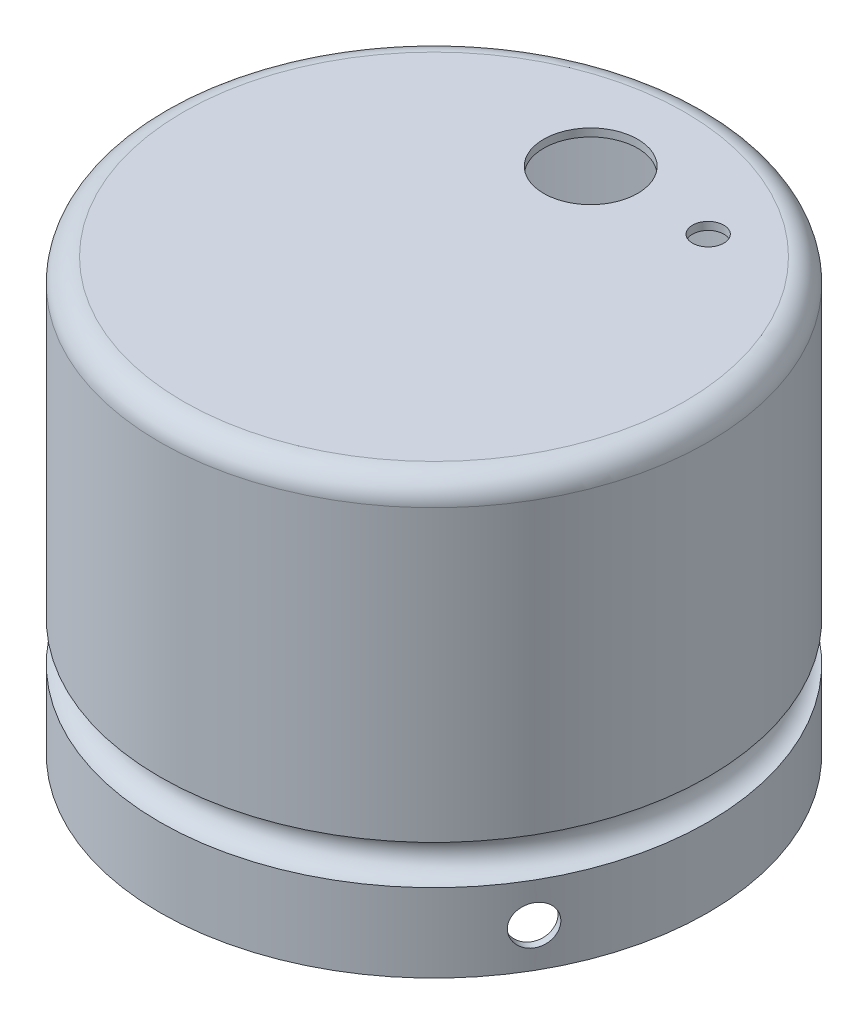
ISO-10303-21;
HEADER;
FILE_DESCRIPTION(('STEP AP214'),'2;1');
FILE_NAME('part.step','',(''),(''),'','','');
FILE_SCHEMA(('AUTOMOTIVE_DESIGN { 1 0 10303 214 1 1 1 1 }'));
ENDSEC;
DATA;
#1=APPLICATION_CONTEXT('core data for automotive mechanical design processes');
#2=APPLICATION_PROTOCOL_DEFINITION('international standard','automotive_design',2000,#1);
#3=PRODUCT_CONTEXT('',#1,'mechanical');
#4=PRODUCT('Part','Part','',(#3));
#5=PRODUCT_RELATED_PRODUCT_CATEGORY('part','',(#4));
#6=PRODUCT_DEFINITION_FORMATION('','',#4);
#7=PRODUCT_DEFINITION_CONTEXT('part definition',#1,'design');
#8=PRODUCT_DEFINITION('design','',#6,#7);
#9=PRODUCT_DEFINITION_SHAPE('','',#8);
#10=(LENGTH_UNIT() NAMED_UNIT(*) SI_UNIT(.MILLI.,.METRE.));
#11=(NAMED_UNIT(*) PLANE_ANGLE_UNIT() SI_UNIT($,.RADIAN.));
#12=(NAMED_UNIT(*) SI_UNIT($,.STERADIAN.) SOLID_ANGLE_UNIT());
#13=UNCERTAINTY_MEASURE_WITH_UNIT(LENGTH_MEASURE(1.E-05),#10,'distance_accuracy_value','');
#14=(GEOMETRIC_REPRESENTATION_CONTEXT(3) GLOBAL_UNCERTAINTY_ASSIGNED_CONTEXT((#13)) GLOBAL_UNIT_ASSIGNED_CONTEXT((#10,
#11,#12)) REPRESENTATION_CONTEXT('',''));
#15=CARTESIAN_POINT('',(0.,0.,0.));
#16=DIRECTION('',(0.,0.,1.));
#17=DIRECTION('',(1.,0.,0.));
#18=AXIS2_PLACEMENT_3D('',#15,#16,#17);
#19=CARTESIAN_POINT('',(0.,99.411581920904,0.));
#20=DIRECTION('',(0.,1.,0.));
#21=DIRECTION('',(0.,0.,1.));
#22=AXIS2_PLACEMENT_3D('',#19,#20,#21);
#23=CYLINDRICAL_SURFACE('',#22,35.);
#24=CARTESIAN_POINT('',(31.4834665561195,30.052571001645,15.2902365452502));
#25=CARTESIAN_POINT('',(31.4834645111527,30.1928047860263,15.2902424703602));
#26=CARTESIAN_POINT('',(31.4782867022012,30.3331356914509,15.3009164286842));
#27=CARTESIAN_POINT('',(31.4576455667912,30.6099195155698,15.3433070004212));
#28=CARTESIAN_POINT('',(31.442170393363,30.7463677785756,15.3750478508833));
#29=CARTESIAN_POINT('',(31.4012010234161,31.0113371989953,15.4585485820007));
#30=CARTESIAN_POINT('',(31.3757122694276,31.1398626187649,15.510297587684));
#31=CARTESIAN_POINT('',(31.3151712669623,31.3853950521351,15.6321673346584));
#32=CARTESIAN_POINT('',(31.2801211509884,31.5024046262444,15.7022839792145));
#33=CARTESIAN_POINT('',(31.2010359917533,31.7218411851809,15.8588472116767));
#34=CARTESIAN_POINT('',(31.1569857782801,31.8242430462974,15.945321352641));
#35=CARTESIAN_POINT('',(31.060807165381,32.0113419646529,16.1318705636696));
#36=CARTESIAN_POINT('',(31.0086784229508,32.0960382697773,16.2319462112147));
#37=CARTESIAN_POINT('',(30.8973975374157,32.2454020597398,16.4427804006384));
#38=CARTESIAN_POINT('',(30.8382380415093,32.3100483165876,16.5535501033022));
#39=CARTESIAN_POINT('',(30.7143127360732,32.4173410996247,16.7823688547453));
#40=CARTESIAN_POINT('',(30.6495470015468,32.4599879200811,16.9004178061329));
#41=CARTESIAN_POINT('',(30.5161524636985,32.5220003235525,17.1401052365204));
#42=CARTESIAN_POINT('',(30.4475305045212,32.541405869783,17.2617371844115));
#43=CARTESIAN_POINT('',(30.3081751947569,32.5565083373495,17.5052618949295));
#44=CARTESIAN_POINT('',(30.2374418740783,32.5522055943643,17.6271546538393));
#45=CARTESIAN_POINT('',(30.0960316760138,32.5200464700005,17.8675205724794));
#46=CARTESIAN_POINT('',(30.0253549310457,32.4922330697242,17.9859995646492));
#47=CARTESIAN_POINT('',(29.8860736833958,32.4139089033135,18.2164965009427));
#48=CARTESIAN_POINT('',(29.8174691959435,32.3633979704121,18.3285143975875));
#49=CARTESIAN_POINT('',(29.6844547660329,32.241064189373,18.5431691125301));
#50=CARTESIAN_POINT('',(29.6200487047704,32.1692219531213,18.6457972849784));
#51=CARTESIAN_POINT('',(29.4976358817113,32.0062789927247,18.8388578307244));
#52=CARTESIAN_POINT('',(29.439629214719,31.9151779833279,18.9292900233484));
#53=CARTESIAN_POINT('',(29.3318903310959,31.7160609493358,19.0958134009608));
#54=CARTESIAN_POINT('',(29.2821768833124,31.6080076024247,19.1718721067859));
#55=CARTESIAN_POINT('',(29.1929570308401,31.3781836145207,19.3074562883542));
#56=CARTESIAN_POINT('',(29.1534506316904,31.2564129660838,19.3669817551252));
#57=CARTESIAN_POINT('',(29.0860934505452,31.0025861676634,19.4679961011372));
#58=CARTESIAN_POINT('',(29.0582436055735,30.8705291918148,19.509483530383));
#59=CARTESIAN_POINT('',(29.0152525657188,30.5998899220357,19.5733649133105));
#60=CARTESIAN_POINT('',(29.0001111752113,30.4613077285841,19.5957591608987));
#61=CARTESIAN_POINT('',(28.9831340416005,30.1818794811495,19.6208607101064));
#62=CARTESIAN_POINT('',(28.9812689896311,30.0410391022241,19.623611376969));
#63=CARTESIAN_POINT('',(28.9908383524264,29.7608044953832,19.6094712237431));
#64=CARTESIAN_POINT('',(29.0022726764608,29.6214102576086,19.5925805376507));
#65=CARTESIAN_POINT('',(29.0379852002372,29.348173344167,19.5396116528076));
#66=CARTESIAN_POINT('',(29.0622499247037,29.2143250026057,19.5035535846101));
#67=CARTESIAN_POINT('',(29.1227031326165,28.9558042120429,19.4131682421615));
#68=CARTESIAN_POINT('',(29.1588917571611,28.8311318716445,19.3588407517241));
#69=CARTESIAN_POINT('',(29.2419348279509,28.5942626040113,19.2331720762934));
#70=CARTESIAN_POINT('',(29.2888078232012,28.4820878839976,19.1618012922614));
#71=CARTESIAN_POINT('',(29.3915016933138,28.2736220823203,19.0039068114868));
#72=CARTESIAN_POINT('',(29.4473226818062,28.1773312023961,18.9173829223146));
#73=CARTESIAN_POINT('',(29.5660790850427,28.0031893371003,18.7312347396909));
#74=CARTESIAN_POINT('',(29.6290272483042,27.9253721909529,18.6315869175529));
#75=CARTESIAN_POINT('',(29.7598326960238,27.7906185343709,18.4219326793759));
#76=CARTESIAN_POINT('',(29.827689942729,27.7336818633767,18.3119263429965));
#77=CARTESIAN_POINT('',(29.9660481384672,27.6423639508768,18.0846241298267));
#78=CARTESIAN_POINT('',(30.0365465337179,27.6079614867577,17.9673352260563));
#79=CARTESIAN_POINT('',(30.1780650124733,27.5626191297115,17.7286107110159));
#80=CARTESIAN_POINT('',(30.249085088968,27.5516789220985,17.6071751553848));
#81=CARTESIAN_POINT('',(30.3894063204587,27.553574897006,17.3638608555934));
#82=CARTESIAN_POINT('',(30.4587109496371,27.5663582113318,17.241983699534));
#83=CARTESIAN_POINT('',(30.5938636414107,27.6152284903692,17.0010175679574));
#84=CARTESIAN_POINT('',(30.6597116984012,27.6513154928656,16.8819285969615));
#85=CARTESIAN_POINT('',(30.7862681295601,27.7457561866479,16.6500197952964));
#86=CARTESIAN_POINT('',(30.8469766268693,27.8041093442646,16.537199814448));
#87=CARTESIAN_POINT('',(30.9618224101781,27.9414192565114,16.3211683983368));
#88=CARTESIAN_POINT('',(31.0159598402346,28.0203755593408,16.2179567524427));
#89=CARTESIAN_POINT('',(31.1165941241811,28.1968477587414,16.0240304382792));
#90=CARTESIAN_POINT('',(31.1630746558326,28.2944023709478,15.9333425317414));
#91=CARTESIAN_POINT('',(31.2473275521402,28.5052403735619,15.7674728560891));
#92=CARTESIAN_POINT('',(31.2850977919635,28.6185275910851,15.692294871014));
#93=CARTESIAN_POINT('',(31.3512505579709,28.857779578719,15.5597109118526));
#94=CARTESIAN_POINT('',(31.3796190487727,28.9837629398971,15.5023315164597));
#95=CARTESIAN_POINT('',(31.4263576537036,29.2446064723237,15.4073642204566));
#96=CARTESIAN_POINT('',(31.4447393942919,29.3794561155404,15.369753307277));
#97=CARTESIAN_POINT('',(31.4664605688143,29.6046947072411,15.3252147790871));
#98=CARTESIAN_POINT('',(31.4728323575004,29.6936304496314,15.3121167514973));
#99=CARTESIAN_POINT('',(31.4813360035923,29.8725544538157,15.2946257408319));
#100=CARTESIAN_POINT('',(31.4834678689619,29.9625427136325,15.2902327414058));
#101=CARTESIAN_POINT('',(31.4834665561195,30.052571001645,15.2902365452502));
#102=B_SPLINE_CURVE_WITH_KNOTS('',3,(#24,#25,#26,#27,#28,#29,#30,#31,#32,#33,#34,#35,#36,#37,
#38,#39,#40,#41,#42,#43,#44,#45,#46,#47,#48,#49,#50,#51,#52,#53,#54,#55,#56,#57,#58,#59,#60,#61,
#62,#63,#64,#65,#66,#67,#68,#69,#70,#71,#72,#73,#74,#75,#76,#77,#78,#79,#80,#81,#82,#83,#84,#85,
#86,#87,#88,#89,#90,#91,#92,#93,#94,#95,#96,#97,#98,#99,#100,#101),.UNSPECIFIED.,.T.,.F.,(4,2,2,
2,2,2,2,2,2,2,2,2,2,2,2,2,2,2,2,2,2,2,2,2,2,2,2,2,2,2,2,2,2,2,2,2,2,2,4),(0.,0.420372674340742,
0.841229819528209,1.26185853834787,1.68239351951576,2.10364327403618,2.52491091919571,
2.94662307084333,3.36832958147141,3.78930992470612,4.21028430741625,4.63049074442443,
5.05070026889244,5.47129289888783,5.89189175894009,6.31342995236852,6.73496837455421,
7.1565406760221,7.57810648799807,7.99874136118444,8.41937336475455,8.83956446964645,
9.2597605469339,9.68069175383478,10.101628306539,10.5233300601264,10.9450285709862,
11.3663293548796,11.7876244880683,12.2079818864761,12.6283399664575,13.0486879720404,
13.4690267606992,13.8902503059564,14.311576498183,14.7335288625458,15.1549889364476,
15.4248632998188,15.694737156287),.UNSPECIFIED.);
#103=CARTESIAN_POINT('',(31.4834665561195,30.052571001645,15.2902365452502));
#104=VERTEX_POINT('',#103);
#105=EDGE_CURVE('E108',#104,#104,#102,.T.);
#106=ORIENTED_EDGE('',*,*,#105,.F.);
#107=EDGE_LOOP('',(#106));
#108=FACE_BOUND('',#107,.T.);
#109=CARTESIAN_POINT('',(0.,35.052571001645,0.));
#110=DIRECTION('',(0.,1.,0.));
#111=DIRECTION('',(0.,0.,1.));
#112=AXIS2_PLACEMENT_3D('',#109,#110,#111);
#113=CIRCLE('',#112,35.);
#114=CARTESIAN_POINT('',(0.,35.052571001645,35.));
#115=VERTEX_POINT('',#114);
#116=EDGE_CURVE('E45',#115,#115,#113,.T.);
#117=ORIENTED_EDGE('',*,*,#116,.F.);
#118=EDGE_LOOP('',(#117));
#119=FACE_BOUND('',#118,.T.);
#120=CARTESIAN_POINT('',(0.,25.052571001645,0.));
#121=DIRECTION('',(0.,1.,0.));
#122=DIRECTION('',(0.,0.,1.));
#123=AXIS2_PLACEMENT_3D('',#120,#121,#122);
#124=CIRCLE('',#123,35.);
#125=CARTESIAN_POINT('',(0.,25.052571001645,35.));
#126=VERTEX_POINT('',#125);
#127=EDGE_CURVE('E50',#126,#126,#124,.T.);
#128=ORIENTED_EDGE('',*,*,#127,.T.);
#129=EDGE_LOOP('',(#128));
#130=FACE_BOUND('',#129,.T.);
#131=CARTESIAN_POINT('',(-2.5,30.052571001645,-34.9106001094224));
#132=CARTESIAN_POINT('',(-2.49999384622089,30.1928047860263,-34.9106013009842));
#133=CARTESIAN_POINT('',(-2.48816102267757,30.3331356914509,-34.9114541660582));
#134=CARTESIAN_POINT('',(-2.44112914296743,30.6099195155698,-34.9147737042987));
#135=CARTESIAN_POINT('',(-2.40590317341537,30.7463677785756,-34.9172422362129));
#136=CARTESIAN_POINT('',(-2.31310473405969,31.0113371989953,-34.9235120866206));
#137=CARTESIAN_POINT('',(-2.25554440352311,31.1398626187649,-34.9273126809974));
#138=CARTESIAN_POINT('',(-2.11973160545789,31.3853950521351,-34.935817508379));
#139=CARTESIAN_POINT('',(-2.04148375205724,31.5024046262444,-34.9405215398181));
#140=CARTESIAN_POINT('',(-1.8663534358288,31.7218411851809,-34.9503133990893));
#141=CARTESIAN_POINT('',(-1.76943952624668,31.8242430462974,-34.9554018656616));
#142=CARTESIAN_POINT('',(-1.55979386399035,32.0113419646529,-34.9653833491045));
#143=CARTESIAN_POINT('',(-1.44706143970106,32.0960382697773,-34.9702763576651));
#144=CARTESIAN_POINT('',(-1.20883323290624,32.2454020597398,-34.979321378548));
#145=CARTESIAN_POINT('',(-1.08332410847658,32.3100483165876,-34.9834726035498));
#146=CARTESIAN_POINT('',(-0.823198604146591,32.4173410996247,-34.990559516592));
#147=CARTESIAN_POINT('',(-0.688582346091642,32.4599879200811,-34.9934952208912));
#148=CARTESIAN_POINT('',(-0.414309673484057,32.5220003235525,-34.9978158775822));
#149=CARTESIAN_POINT('',(-0.274662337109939,32.541405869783,-34.9992034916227));
#150=CARTESIAN_POINT('',(0.00591390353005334,32.5565083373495,-35.0002806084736));
#151=CARTESIAN_POINT('',(0.146842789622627,32.5522055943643,-34.9999701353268));
#152=CARTESIAN_POINT('',(0.425710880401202,32.5200464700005,-34.9976882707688));
#153=CARTESIAN_POINT('',(0.563655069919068,32.4922330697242,-34.9957199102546));
#154=CARTESIAN_POINT('',(0.832911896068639,32.4139089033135,-34.9903472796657));
#155=CARTESIAN_POINT('',(0.964224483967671,32.3633979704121,-34.9869429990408));
#156=CARTESIAN_POINT('',(1.21662813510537,32.241064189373,-34.9790764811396));
#157=CARTESIAN_POINT('',(1.33770977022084,32.1692219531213,-34.9746132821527));
#158=CARTESIAN_POINT('',(1.56611151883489,32.0062789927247,-34.9651309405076));
#159=CARTESIAN_POINT('',(1.67343142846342,31.9151779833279,-34.9601117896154));
#160=CARTESIAN_POINT('',(1.87151434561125,31.7160609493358,-34.9500688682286));
#161=CARTESIAN_POINT('',(1.96223984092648,31.6080076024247,-34.9450451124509));
#162=CARTESIAN_POINT('',(2.12426911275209,31.3781836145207,-34.9355705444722));
#163=CARTESIAN_POINT('',(2.19557287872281,31.2564129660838,-34.931119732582));
#164=CARTESIAN_POINT('',(2.31673245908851,31.0025861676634,-34.9232938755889));
#165=CARTESIAN_POINT('',(2.36658654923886,30.8705291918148,-34.9199189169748));
#166=CARTESIAN_POINT('',(2.4434049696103,30.5998899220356,-34.9146282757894));
#167=CARTESIAN_POINT('',(2.47036965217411,30.4613077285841,-34.9127125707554));
#168=CARTESIAN_POINT('',(2.50059679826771,30.1818794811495,-34.9105607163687));
#169=CARTESIAN_POINT('',(2.50391147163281,30.0410391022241,-34.9103208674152));
#170=CARTESIAN_POINT('',(2.48688105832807,29.7608044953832,-34.911538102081));
#171=CARTESIAN_POINT('',(2.4665361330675,29.6214102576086,-34.9129951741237));
#172=CARTESIAN_POINT('',(2.40280747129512,29.348173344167,-34.9174386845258));
#173=CARTESIAN_POINT('',(2.35944790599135,29.2143250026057,-34.9204235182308));
#174=CARTESIAN_POINT('',(2.25094529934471,28.9558042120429,-34.9275848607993));
#175=CARTESIAN_POINT('',(2.18580200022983,28.8311318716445,-34.9317613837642));
#176=CARTESIAN_POINT('',(2.03544819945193,28.5942626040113,-34.9408444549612));
#177=CARTESIAN_POINT('',(1.95020278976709,28.4820878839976,-34.9457522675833));
#178=CARTESIAN_POINT('',(1.76211522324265,28.2736220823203,-34.9557405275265));
#179=CARTESIAN_POINT('',(1.65927284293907,28.1773312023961,-34.9608209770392));
#180=CARTESIAN_POINT('',(1.43868558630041,28.0031893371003,-34.9705929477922));
#181=CARTESIAN_POINT('',(1.32091395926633,27.9253721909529,-34.9752837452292));
#182=CARTESIAN_POINT('',(1.07394533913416,27.7906185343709,-34.9837374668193));
#183=CARTESIAN_POINT('',(0.944748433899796,27.7336818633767,-34.9875003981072));
#184=CARTESIAN_POINT('',(0.678719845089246,27.6423639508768,-34.9936710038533));
#185=CARTESIAN_POINT('',(0.541895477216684,27.6079614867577,-34.9960799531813));
#186=CARTESIAN_POINT('',(0.264394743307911,27.5626191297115,-34.9992762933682));
#187=CARTESIAN_POINT('',(0.123718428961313,27.5516789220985,-35.0000637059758));
#188=CARTESIAN_POINT('',(-0.157158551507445,27.553574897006,-34.9999283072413));
#189=CARTESIAN_POINT('',(-0.2973595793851,27.5663582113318,-34.9990092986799));
#190=CARTESIAN_POINT('',(-0.573618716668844,27.6152284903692,-34.9955718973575));
#191=CARTESIAN_POINT('',(-0.709676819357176,27.6513154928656,-34.9930535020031));
#192=CARTESIAN_POINT('',(-0.973793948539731,27.7457561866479,-34.9867001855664));
#193=CARTESIAN_POINT('',(-1.10185316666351,27.8041093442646,-34.9828652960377));
#194=CARTESIAN_POINT('',(-1.34636475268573,27.9414192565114,-34.9743089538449));
#195=CARTESIAN_POINT('',(-1.46281737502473,28.0203755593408,-34.9695875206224));
#196=CARTESIAN_POINT('',(-1.68107963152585,28.1968477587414,-34.9597762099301));
#197=CARTESIAN_POINT('',(-1.78285792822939,28.2944023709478,-34.9546855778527));
#198=CARTESIAN_POINT('',(-1.96863172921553,28.5052403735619,-34.9447158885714));
#199=CARTESIAN_POINT('',(-2.05262289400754,28.6185275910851,-34.9398368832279));
#200=CARTESIAN_POINT('',(-2.20052035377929,28.857779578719,-34.9308348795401));
#201=CARTESIAN_POINT('',(-2.26439661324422,28.9837629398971,-34.9267130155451));
#202=CARTESIAN_POINT('',(-2.37001000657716,29.2446064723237,-34.9197061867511));
#203=CARTESIAN_POINT('',(-2.41177288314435,29.3794561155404,-34.9168197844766));
#204=CARTESIAN_POINT('',(-2.46120496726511,29.6046947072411,-34.9133616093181));
#205=CARTESIAN_POINT('',(-2.47573408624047,29.6936304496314,-34.9123307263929));
#206=CARTESIAN_POINT('',(-2.49513356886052,29.8725544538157,-34.9109495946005));
#207=CARTESIAN_POINT('',(-2.50000395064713,29.9625427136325,-34.910599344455));
#208=CARTESIAN_POINT('',(-2.5,30.052571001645,-34.9106001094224));
#209=B_SPLINE_CURVE_WITH_KNOTS('',3,(#131,#132,#133,#134,#135,#136,#137,#138,#139,#140,#141,
#142,#143,#144,#145,#146,#147,#148,#149,#150,#151,#152,#153,#154,#155,#156,#157,#158,#159,#160,
#161,#162,#163,#164,#165,#166,#167,#168,#169,#170,#171,#172,#173,#174,#175,#176,#177,#178,#179,
#180,#181,#182,#183,#184,#185,#186,#187,#188,#189,#190,#191,#192,#193,#194,#195,#196,#197,#198,
#199,#200,#201,#202,#203,#204,#205,#206,#207,#208),.UNSPECIFIED.,.T.,.F.,(4,2,2,2,2,2,2,2,2,2,2,
2,2,2,2,2,2,2,2,2,2,2,2,2,2,2,2,2,2,2,2,2,2,2,2,2,2,2,4),(0.,0.420372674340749,
0.841229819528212,1.26185853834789,1.68239351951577,2.10364327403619,2.52491091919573,
2.94662307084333,3.36832958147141,3.78930992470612,4.21028430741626,4.63049074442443,
5.05070026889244,5.47129289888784,5.89189175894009,6.31342995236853,6.73496837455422,
7.15654067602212,7.57810648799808,7.99874136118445,8.41937336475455,8.83956446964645,
9.25976054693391,9.68069175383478,10.101628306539,10.5233300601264,10.9450285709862,
11.3663293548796,11.7876244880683,12.2079818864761,12.6283399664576,13.0486879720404,
13.4690267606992,13.8902503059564,14.311576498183,14.7335288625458,15.1549889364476,
15.4248632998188,15.694737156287),.UNSPECIFIED.);
#210=CARTESIAN_POINT('',(-2.5,30.052571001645,-34.9106001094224));
#211=VERTEX_POINT('',#210);
#212=EDGE_CURVE('E87',#211,#211,#209,.T.);
#213=ORIENTED_EDGE('',*,*,#212,.F.);
#214=EDGE_LOOP('',(#213));
#215=FACE_BOUND('',#214,.T.);
#216=CARTESIAN_POINT('',(-28.9834665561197,30.052571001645,19.620363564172));
#217=CARTESIAN_POINT('',(-28.9834706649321,30.1928047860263,19.6203588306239));
#218=CARTESIAN_POINT('',(-28.9901256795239,30.3331356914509,19.6105377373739));
#219=CARTESIAN_POINT('',(-29.016516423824,30.6099195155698,19.5714667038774));
#220=CARTESIAN_POINT('',(-29.0362672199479,30.7463677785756,19.5421943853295));
#221=CARTESIAN_POINT('',(-29.0880962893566,31.0113371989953,19.4649635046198));
#222=CARTESIAN_POINT('',(-29.1201678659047,31.1398626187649,19.4170150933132));
#223=CARTESIAN_POINT('',(-29.1954396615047,31.3853950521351,19.3036501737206));
#224=CARTESIAN_POINT('',(-29.2386373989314,31.5024046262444,19.2382375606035));
#225=CARTESIAN_POINT('',(-29.3346825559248,31.7218411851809,19.0914661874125));
#226=CARTESIAN_POINT('',(-29.3875462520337,31.8242430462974,19.0100805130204));
#227=CARTESIAN_POINT('',(-29.5010133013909,32.0113419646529,18.8335127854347));
#228=CARTESIAN_POINT('',(-29.56161698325,32.0960382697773,18.7383301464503));
#229=CARTESIAN_POINT('',(-29.6885643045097,32.2454020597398,18.5365409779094));
#230=CARTESIAN_POINT('',(-29.754913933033,32.3100483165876,18.4299225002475));
#231=CARTESIAN_POINT('',(-29.8911141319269,32.4173410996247,18.2081906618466));
#232=CARTESIAN_POINT('',(-29.9609646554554,32.4599879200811,18.0930774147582));
#233=CARTESIAN_POINT('',(-30.1018427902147,32.5220003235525,17.8577106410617));
#234=CARTESIAN_POINT('',(-30.1728681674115,32.541405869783,17.7374663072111));
#235=CARTESIAN_POINT('',(-30.3140890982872,32.5565083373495,17.495018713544));
#236=CARTESIAN_POINT('',(-30.3842846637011,32.5522055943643,17.3728154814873));
#237=CARTESIAN_POINT('',(-30.5217425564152,32.5200464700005,17.1301676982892));
#238=CARTESIAN_POINT('',(-30.5890100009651,32.4922330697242,17.0097203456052));
#239=CARTESIAN_POINT('',(-30.7189855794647,32.4139089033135,16.7738507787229));
#240=CARTESIAN_POINT('',(-30.7816936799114,32.3633979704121,16.6584286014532));
#241=CARTESIAN_POINT('',(-30.9010829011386,32.241064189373,16.4359073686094));
#242=CARTESIAN_POINT('',(-30.9577584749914,32.1692219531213,16.3288159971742));
#243=CARTESIAN_POINT('',(-31.0637474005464,32.0062789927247,16.126273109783));
#244=CARTESIAN_POINT('',(-31.1130606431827,31.9151779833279,16.0308217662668));
#245=CARTESIAN_POINT('',(-31.2034046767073,31.7160609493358,15.8542554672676));
#246=CARTESIAN_POINT('',(-31.2444167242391,31.6080076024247,15.7731730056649));
#247=CARTESIAN_POINT('',(-31.3172261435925,31.3781836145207,15.6281142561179));
#248=CARTESIAN_POINT('',(-31.3490235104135,31.2564129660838,15.5641379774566));
#249=CARTESIAN_POINT('',(-31.4028259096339,31.0025861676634,15.4552977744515));
#250=CARTESIAN_POINT('',(-31.4248301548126,30.8705291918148,15.4104353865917));
#251=CARTESIAN_POINT('',(-31.4586575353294,30.5998899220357,15.3412633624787));
#252=CARTESIAN_POINT('',(-31.4704808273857,30.4613077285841,15.3169534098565));
#253=CARTESIAN_POINT('',(-31.4837308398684,30.1818794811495,15.2897000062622));
#254=CARTESIAN_POINT('',(-31.4851804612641,30.0410391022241,15.286709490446));
#255=CARTESIAN_POINT('',(-31.4777194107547,29.7608044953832,15.3020668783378));
#256=CARTESIAN_POINT('',(-31.4688088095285,29.6214102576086,15.3204146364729));
#257=CARTESIAN_POINT('',(-31.4407926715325,29.348173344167,15.377827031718));
#258=CARTESIAN_POINT('',(-31.4216978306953,29.2143250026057,15.4168699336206));
#259=CARTESIAN_POINT('',(-31.3736484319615,28.9558042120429,15.5144166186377));
#260=CARTESIAN_POINT('',(-31.3446937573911,28.8311318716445,15.5729206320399));
#261=CARTESIAN_POINT('',(-31.2773830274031,28.5942626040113,15.7076723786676));
#262=CARTESIAN_POINT('',(-31.2390106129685,28.4820878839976,15.7839509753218));
#263=CARTESIAN_POINT('',(-31.1536169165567,28.2736220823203,15.9518337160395));
#264=CARTESIAN_POINT('',(-31.1065955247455,28.1773312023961,16.0434380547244));
#265=CARTESIAN_POINT('',(-31.0047646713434,28.0031893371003,16.2393582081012));
#266=CARTESIAN_POINT('',(-30.9499412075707,27.9253721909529,16.3436968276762));
#267=CARTESIAN_POINT('',(-30.8337780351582,27.7906185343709,16.5618047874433));
#268=CARTESIAN_POINT('',(-30.772438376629,27.7336818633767,16.6755740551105));
#269=CARTESIAN_POINT('',(-30.6447679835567,27.6423639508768,16.9090468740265));
#270=CARTESIAN_POINT('',(-30.5784420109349,27.6079614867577,17.0287447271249));
#271=CARTESIAN_POINT('',(-30.4424597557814,27.5626191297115,17.2706655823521));
#272=CARTESIAN_POINT('',(-30.3728035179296,27.5516789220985,17.3928885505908));
#273=CARTESIAN_POINT('',(-30.2322477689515,27.553574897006,17.6360674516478));
#274=CARTESIAN_POINT('',(-30.1613513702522,27.5663582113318,17.7570255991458));
#275=CARTESIAN_POINT('',(-30.0202449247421,27.6152284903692,17.9945543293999));
#276=CARTESIAN_POINT('',(-29.9500348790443,27.6513154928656,18.1111249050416));
#277=CARTESIAN_POINT('',(-29.8124741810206,27.7457561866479,18.3366803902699));
#278=CARTESIAN_POINT('',(-29.7451234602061,27.8041093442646,18.4456654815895));
#279=CARTESIAN_POINT('',(-29.6154576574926,27.9414192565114,18.653140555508));
#280=CARTESIAN_POINT('',(-29.5531424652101,28.0203755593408,18.7516307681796));
#281=CARTESIAN_POINT('',(-29.4355144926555,28.1968477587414,18.9357457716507));
#282=CARTESIAN_POINT('',(-29.3802167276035,28.2944023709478,19.0213430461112));
#283=CARTESIAN_POINT('',(-29.2786958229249,28.5052403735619,19.1772430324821));
#284=CARTESIAN_POINT('',(-29.2324748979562,28.6185275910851,19.2475420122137));
#285=CARTESIAN_POINT('',(-29.1507302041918,28.857779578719,19.3711239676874));
#286=CARTESIAN_POINT('',(-29.1152224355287,28.9837629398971,19.4243814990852));
#287=CARTESIAN_POINT('',(-29.0563476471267,29.2446064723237,19.5123419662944));
#288=CARTESIAN_POINT('',(-29.0329665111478,29.3794561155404,19.5470664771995));
#289=CARTESIAN_POINT('',(-29.0052556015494,29.6046947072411,19.5881468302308));
#290=CARTESIAN_POINT('',(-28.9970982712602,29.6936304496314,19.6002139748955));
#291=CARTESIAN_POINT('',(-28.986202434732,29.8725544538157,19.6163238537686));
#292=CARTESIAN_POINT('',(-28.983463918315,29.9625427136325,19.6203666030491));
#293=CARTESIAN_POINT('',(-28.9834665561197,30.052571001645,19.620363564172));
#294=B_SPLINE_CURVE_WITH_KNOTS('',3,(#216,#217,#218,#219,#220,#221,#222,#223,#224,#225,#226,
#227,#228,#229,#230,#231,#232,#233,#234,#235,#236,#237,#238,#239,#240,#241,#242,#243,#244,#245,
#246,#247,#248,#249,#250,#251,#252,#253,#254,#255,#256,#257,#258,#259,#260,#261,#262,#263,#264,
#265,#266,#267,#268,#269,#270,#271,#272,#273,#274,#275,#276,#277,#278,#279,#280,#281,#282,#283,
#284,#285,#286,#287,#288,#289,#290,#291,#292,#293),.UNSPECIFIED.,.T.,.F.,(4,2,2,2,2,2,2,2,2,2,2,
2,2,2,2,2,2,2,2,2,2,2,2,2,2,2,2,2,2,2,2,2,2,2,2,2,2,2,4),(0.,0.420372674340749,
0.841229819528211,1.26185853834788,1.68239351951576,2.10364327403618,2.52491091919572,
2.94662307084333,3.36832958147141,3.78930992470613,4.21028430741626,4.63049074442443,
5.05070026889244,5.47129289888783,5.89189175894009,6.31342995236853,6.73496837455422,
7.15654067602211,7.57810648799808,7.99874136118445,8.41937336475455,8.83956446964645,
9.25976054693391,9.68069175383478,10.101628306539,10.5233300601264,10.9450285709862,
11.3663293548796,11.7876244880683,12.2079818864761,12.6283399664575,13.0486879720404,
13.4690267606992,13.8902503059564,14.311576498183,14.7335288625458,15.1549889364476,
15.4248632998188,15.694737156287),.UNSPECIFIED.);
#295=CARTESIAN_POINT('',(-28.9834665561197,30.052571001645,19.620363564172));
#296=VERTEX_POINT('',#295);
#297=EDGE_CURVE('E126',#296,#296,#294,.T.);
#298=ORIENTED_EDGE('',*,*,#297,.F.);
#299=EDGE_LOOP('',(#298));
#300=FACE_BOUND('',#299,.T.);
#301=ADVANCED_FACE('F30',(#108,#119,#130,#215,#300),#23,.T.);
#302=CARTESIAN_POINT('',(0.,99.411581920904,0.));
#303=DIRECTION('',(0.,1.,0.));
#304=DIRECTION('',(0.,0.,1.));
#305=AXIS2_PLACEMENT_3D('',#302,#303,#304);
#306=CYLINDRICAL_SURFACE('',#305,34.);
#307=CARTESIAN_POINT('',(30.6151579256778,30.052571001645,14.788918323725));
#308=CARTESIAN_POINT('',(30.6151559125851,30.1927932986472,14.7889242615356));
#309=CARTESIAN_POINT('',(30.6100007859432,30.33311243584,14.7996090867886));
#310=CARTESIAN_POINT('',(30.5894481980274,30.609872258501,14.8420414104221));
#311=CARTESIAN_POINT('',(30.5740389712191,30.7463083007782,14.8738131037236));
#312=CARTESIAN_POINT('',(30.5332378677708,31.0112532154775,14.9573906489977));
#313=CARTESIAN_POINT('',(30.5078514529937,31.1397663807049,15.0091855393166));
#314=CARTESIAN_POINT('',(30.4475405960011,31.3852767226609,15.1311558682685));
#315=CARTESIAN_POINT('',(30.4126182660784,31.5022764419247,15.2013272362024));
#316=CARTESIAN_POINT('',(30.333796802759,31.7217081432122,15.3580094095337));
#317=CARTESIAN_POINT('',(30.2898816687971,31.8241135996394,15.4445493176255));
#318=CARTESIAN_POINT('',(30.193968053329,32.0112223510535,15.6312277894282));
#319=CARTESIAN_POINT('',(30.1419692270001,32.0959248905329,15.7313669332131));
#320=CARTESIAN_POINT('',(30.0309247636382,32.2453088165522,15.9423260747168));
#321=CARTESIAN_POINT('',(29.9718713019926,32.3099676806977,16.0531579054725));
#322=CARTESIAN_POINT('',(29.8481249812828,32.417284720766,16.2820867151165));
#323=CARTESIAN_POINT('',(29.7834322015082,32.4599432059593,16.4001835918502));
#324=CARTESIAN_POINT('',(29.6501490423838,32.5219733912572,16.6399347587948));
#325=CARTESIAN_POINT('',(29.581565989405,32.5413874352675,16.7615821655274));
#326=CARTESIAN_POINT('',(29.442244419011,32.5565084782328,17.0051145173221));
#327=CARTESIAN_POINT('',(29.3715059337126,32.5522158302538,17.1269994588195));
#328=CARTESIAN_POINT('',(29.2300503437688,32.520080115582,17.3673131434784));
#329=CARTESIAN_POINT('',(29.1593334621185,32.4922825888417,17.4857481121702));
#330=CARTESIAN_POINT('',(29.019934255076,32.4139969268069,17.716138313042));
#331=CARTESIAN_POINT('',(28.9512519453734,32.3635086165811,17.8280934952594));
#332=CARTESIAN_POINT('',(28.8180491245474,32.2412233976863,18.0426167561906));
#333=CARTESIAN_POINT('',(28.753532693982,32.1694059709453,18.145175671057));
#334=CARTESIAN_POINT('',(28.6308819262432,32.0065160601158,18.3380939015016));
#335=CARTESIAN_POINT('',(28.5727476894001,31.915443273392,18.4284530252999));
#336=CARTESIAN_POINT('',(28.4647421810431,31.716370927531,18.5948470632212));
#337=CARTESIAN_POINT('',(28.414890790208,31.6083318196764,18.670847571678));
#338=CARTESIAN_POINT('',(28.3254078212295,31.3785318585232,18.8063256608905));
#339=CARTESIAN_POINT('',(28.2857762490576,31.2567709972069,18.8658032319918));
#340=CARTESIAN_POINT('',(28.2181947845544,31.0029573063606,18.9667390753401));
#341=CARTESIAN_POINT('',(28.1902459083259,30.8709035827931,19.0081957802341));
#342=CARTESIAN_POINT('',(28.1470942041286,30.6002651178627,19.0720367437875));
#343=CARTESIAN_POINT('',(28.1318911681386,30.4616804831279,19.0944213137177));
#344=CARTESIAN_POINT('',(28.1148359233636,30.1822612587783,19.1195249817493));
#345=CARTESIAN_POINT('',(28.1129525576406,30.0414326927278,19.1222899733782));
#346=CARTESIAN_POINT('',(28.122526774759,29.7612181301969,19.1082065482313));
#347=CARTESIAN_POINT('',(28.1339842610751,29.6218321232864,19.0913582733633));
#348=CARTESIAN_POINT('',(28.1697793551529,29.3486169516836,19.0385014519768));
#349=CARTESIAN_POINT('',(28.1941026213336,29.2147817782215,19.0025142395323));
#350=CARTESIAN_POINT('',(28.2547003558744,28.9562815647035,18.9122934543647));
#351=CARTESIAN_POINT('',(28.2909749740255,28.8316166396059,18.8580596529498));
#352=CARTESIAN_POINT('',(28.3742107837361,28.5947420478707,18.7325870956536));
#353=CARTESIAN_POINT('',(28.4211916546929,28.4825558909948,18.661317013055));
#354=CARTESIAN_POINT('',(28.524106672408,28.2740606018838,18.5036261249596));
#355=CARTESIAN_POINT('',(28.5800409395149,28.1777516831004,18.4172051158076));
#356=CARTESIAN_POINT('',(28.6990228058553,28.0035568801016,18.2312444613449));
#357=CARTESIAN_POINT('',(28.7620839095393,27.9257068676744,18.1316798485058));
#358=CARTESIAN_POINT('',(28.8930959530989,27.7908855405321,17.9221720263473));
#359=CARTESIAN_POINT('',(28.9610468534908,27.7339140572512,17.8122289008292));
#360=CARTESIAN_POINT('',(29.0995584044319,27.6425290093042,17.5850325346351));
#361=CARTESIAN_POINT('',(29.1701163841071,27.6080929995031,17.4677866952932));
#362=CARTESIAN_POINT('',(29.3117163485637,27.5626830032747,17.2291186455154));
#363=CARTESIAN_POINT('',(29.3827583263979,27.5517086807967,17.1076964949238));
#364=CARTESIAN_POINT('',(29.5230732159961,27.5535371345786,16.8643951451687));
#365=CARTESIAN_POINT('',(29.5923499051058,27.5662838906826,16.7425176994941));
#366=CARTESIAN_POINT('',(29.727409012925,27.6150761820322,16.5015223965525));
#367=CARTESIAN_POINT('',(29.7931914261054,27.651121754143,16.3824045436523));
#368=CARTESIAN_POINT('',(29.9195858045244,27.745474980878,16.1504132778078));
#369=CARTESIAN_POINT('',(29.9801979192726,27.8037819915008,16.0375396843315));
#370=CARTESIAN_POINT('',(30.0948319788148,27.9409960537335,15.821380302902));
#371=CARTESIAN_POINT('',(30.1488540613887,28.0199026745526,15.7180943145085));
#372=CARTESIAN_POINT('',(30.2492590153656,28.1962854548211,15.5239916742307));
#373=CARTESIAN_POINT('',(30.2956245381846,28.2938027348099,15.4332034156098));
#374=CARTESIAN_POINT('',(30.3796550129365,28.5045713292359,15.2671296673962));
#375=CARTESIAN_POINT('',(30.4173178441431,28.6178264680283,15.1918479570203));
#376=CARTESIAN_POINT('',(30.4832791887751,28.8570294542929,15.059057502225));
#377=CARTESIAN_POINT('',(30.5115631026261,28.9829966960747,15.0015764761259));
#378=CARTESIAN_POINT('',(30.5581642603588,29.2438183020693,14.9064224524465));
#379=CARTESIAN_POINT('',(30.5764930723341,29.3786621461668,14.8687264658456));
#380=CARTESIAN_POINT('',(30.5981715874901,29.6040257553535,14.8240428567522));
#381=CARTESIAN_POINT('',(30.6045360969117,29.6930922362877,14.8108901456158));
#382=CARTESIAN_POINT('',(30.6130299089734,29.8722828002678,14.7933259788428));
#383=CARTESIAN_POINT('',(30.6151592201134,29.9624068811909,14.7889145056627));
#384=CARTESIAN_POINT('',(30.6151579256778,30.052571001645,14.788918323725));
#385=B_SPLINE_CURVE_WITH_KNOTS('',3,(#307,#308,#309,#310,#311,#312,#313,#314,#315,#316,#317,
#318,#319,#320,#321,#322,#323,#324,#325,#326,#327,#328,#329,#330,#331,#332,#333,#334,#335,#336,
#337,#338,#339,#340,#341,#342,#343,#344,#345,#346,#347,#348,#349,#350,#351,#352,#353,#354,#355,
#356,#357,#358,#359,#360,#361,#362,#363,#364,#365,#366,#367,#368,#369,#370,#371,#372,#373,#374,
#375,#376,#377,#378,#379,#380,#381,#382,#383,#384),.UNSPECIFIED.,.T.,.F.,(4,2,2,2,2,2,2,2,2,2,2,
2,2,2,2,2,2,2,2,2,2,2,2,2,2,2,2,2,2,2,2,2,2,2,2,2,2,2,4),(0.,0.420337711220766,0.84115855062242,
1.26174933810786,1.68224703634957,2.10349951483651,2.52476996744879,2.9465120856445,
3.36824827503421,3.78921502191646,4.21017549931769,4.63032224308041,5.05047222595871,
5.47102769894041,5.89158978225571,6.31314716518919,6.73470479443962,7.15629908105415,
7.57788648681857,7.99848740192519,8.41908527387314,8.83921528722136,9.25935056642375,
9.68026442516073,10.1011839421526,10.5229148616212,10.9446423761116,11.3659492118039,
11.7872500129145,12.2075571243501,12.6278649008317,13.04816051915,13.4684473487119,
13.8896737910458,14.3110027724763,14.7329845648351,15.1544749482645,15.4247561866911,
15.6950368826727),.UNSPECIFIED.);
#386=CARTESIAN_POINT('',(30.6151579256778,30.052571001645,14.788918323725));
#387=VERTEX_POINT('',#386);
#388=EDGE_CURVE('E112',#387,#387,#385,.T.);
#389=ORIENTED_EDGE('',*,*,#388,.T.);
#390=EDGE_LOOP('',(#389));
#391=FACE_BOUND('',#390,.T.);
#392=CARTESIAN_POINT('',(0.,34.1984690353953,0.));
#393=DIRECTION('',(0.,1.,0.));
#394=DIRECTION('',(0.,0.,1.));
#395=AXIS2_PLACEMENT_3D('',#392,#393,#394);
#396=CIRCLE('',#395,34.);
#397=CARTESIAN_POINT('',(0.,34.1984690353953,34.));
#398=VERTEX_POINT('',#397);
#399=EDGE_CURVE('E57',#398,#398,#396,.T.);
#400=ORIENTED_EDGE('',*,*,#399,.T.);
#401=EDGE_LOOP('',(#400));
#402=FACE_BOUND('',#401,.T.);
#403=CARTESIAN_POINT('',(0.,25.052571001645,0.));
#404=DIRECTION('',(0.,-1.,0.));
#405=DIRECTION('',(0.,0.,-1.));
#406=AXIS2_PLACEMENT_3D('',#403,#404,#405);
#407=CIRCLE('',#406,34.);
#408=CARTESIAN_POINT('',(0.,25.052571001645,-34.));
#409=VERTEX_POINT('',#408);
#410=EDGE_CURVE('E54',#409,#409,#407,.F.);
#411=ORIENTED_EDGE('',*,*,#410,.F.);
#412=EDGE_LOOP('',(#411));
#413=FACE_BOUND('',#412,.T.);
#414=CARTESIAN_POINT('',(-2.5,30.052571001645,-33.9079636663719));
#415=CARTESIAN_POINT('',(-2.49999385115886,30.1927932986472,-33.9079648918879));
#416=CARTESIAN_POINT('',(-2.48816295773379,30.33311243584,-33.9088428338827));
#417=CARTESIAN_POINT('',(-2.44113919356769,30.609872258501,-33.9122599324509));
#418=CARTESIAN_POINT('',(-2.40591948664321,30.7463083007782,-33.9148009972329));
#419=CARTESIAN_POINT('',(-2.31313865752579,31.0112532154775,-33.9212549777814));
#420=CARTESIAN_POINT('',(-2.25558975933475,31.1397663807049,-33.9251671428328));
#421=CARTESIAN_POINT('',(-2.11980492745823,31.3852767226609,-33.9339215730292));
#422=CARTESIAN_POINT('',(-2.04157357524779,31.5022764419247,-33.9387636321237));
#423=CARTESIAN_POINT('',(-1.86647210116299,31.7217081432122,-33.9488433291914));
#424=CARTESIAN_POINT('',(-1.7695687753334,31.8241135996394,-33.9540816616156));
#425=CARTESIAN_POINT('',(-1.55994366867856,32.0112223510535,-33.9643572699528));
#426=CARTESIAN_POINT('',(-1.44722121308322,32.0959248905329,-33.9693945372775));
#427=CARTESIAN_POINT('',(-1.20900300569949,32.2453088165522,-33.9787067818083));
#428=CARTESIAN_POINT('',(-1.08349309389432,32.3099676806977,-33.9829808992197));
#429=CARTESIAN_POINT('',(-0.823361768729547,32.417284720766,-33.9902778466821));
#430=CARTESIAN_POINT('',(-0.688740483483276,32.4599432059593,-33.9933006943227));
#431=CARTESIAN_POINT('',(-0.414468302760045,32.5219733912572,-33.9977496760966));
#432=CARTESIAN_POINT('',(-0.27482703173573,32.5413874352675,-33.9991787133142));
#433=CARTESIAN_POINT('',(0.00573895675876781,32.5565084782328,-34.0002888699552));
#434=CARTESIAN_POINT('',(0.14666365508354,32.5522158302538,-33.9999700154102));
#435=CARTESIAN_POINT('',(0.425509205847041,32.520080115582,-33.9976227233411));
#436=CARTESIAN_POINT('',(0.563435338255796,32.4922825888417,-33.9955975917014));
#437=CARTESIAN_POINT('',(0.832658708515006,32.4139969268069,-33.9900694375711));
#438=CARTESIAN_POINT('',(0.96395589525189,32.3635086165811,-33.9865664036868));
#439=CARTESIAN_POINT('',(1.21633989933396,32.2412233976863,-33.9784710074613));
#440=CARTESIAN_POINT('',(1.33741674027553,32.1694059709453,-33.9738775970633));
#441=CARTESIAN_POINT('',(1.56581421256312,32.0065160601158,-33.9641180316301));
#442=CARTESIAN_POINT('',(1.67313462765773,31.9154432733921,-33.9589518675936));
#443=CARTESIAN_POINT('',(1.8712388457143,31.716370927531,-33.9486133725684));
#444=CARTESIAN_POINT('',(1.96198291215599,31.6083318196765,-33.9434410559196));
#445=CARTESIAN_POINT('',(2.12405186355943,31.3785318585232,-33.9336855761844));
#446=CARTESIAN_POINT('',(2.19537673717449,31.2567709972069,-33.9291024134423));
#447=CARTESIAN_POINT('',(2.31658047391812,31.0029573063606,-33.9210430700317));
#448=CARTESIAN_POINT('',(2.3664574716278,30.8709035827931,-33.9175669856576));
#449=CARTESIAN_POINT('',(2.4433212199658,30.6002651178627,-33.9121169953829));
#450=CARTESIAN_POINT('',(2.47030834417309,30.4616804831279,-33.910143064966));
#451=CARTESIAN_POINT('',(2.50057638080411,30.1822612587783,-33.9079246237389));
#452=CARTESIAN_POINT('',(2.50391261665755,30.0414326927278,-33.9076760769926));
#453=CARTESIAN_POINT('',(2.48692890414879,29.7612181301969,-33.908925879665));
#454=CARTESIAN_POINT('',(2.46660912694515,29.6218321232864,-33.9104242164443));
#455=CARTESIAN_POINT('',(2.4029362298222,29.3486169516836,-33.9149952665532));
#456=CARTESIAN_POINT('',(2.35960875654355,29.2147817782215,-33.9180662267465));
#457=CARTESIAN_POINT('',(2.25117639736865,28.9562815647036,-33.9254350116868));
#458=CARTESIAN_POINT('',(2.186071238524,28.8316166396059,-33.9297328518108));
#459=CARTESIAN_POINT('',(2.03579091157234,28.5947420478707,-33.9390808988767));
#460=CARTESIAN_POINT('',(1.95057877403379,28.4825558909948,-33.9441324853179));
#461=CARTESIAN_POINT('',(1.76255695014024,28.2740606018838,-33.9544140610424));
#462=CARTESIAN_POINT('',(1.65974702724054,28.1777516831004,-33.959644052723));
#463=CARTESIAN_POINT('',(1.43920944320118,28.0035568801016,-33.9697050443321));
#464=CARTESIAN_POINT('',(1.32145340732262,27.9257068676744,-33.9745352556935));
#465=CARTESIAN_POINT('',(1.07450828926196,27.7908855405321,-33.9832411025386));
#466=CARTESIAN_POINT('',(0.945319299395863,27.7339140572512,-33.987116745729));
#467=CARTESIAN_POINT('',(0.679305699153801,27.6425290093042,-33.9934730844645));
#468=CARTESIAN_POINT('',(0.542488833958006,27.6080929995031,-33.995955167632));
#469=CARTESIAN_POINT('',(0.26499625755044,27.5626830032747,-33.9992503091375));
#470=CARTESIAN_POINT('',(0.124320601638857,27.5517086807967,-34.0000633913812));
#471=CARTESIAN_POINT('',(-0.156541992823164,27.5535371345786,-33.9999289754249));
#472=CARTESIAN_POINT('',(-0.296729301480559,27.5662838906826,-33.9989856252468));
#473=CARTESIAN_POINT('',(-0.572966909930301,27.6150761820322,-33.9954525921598));
#474=CARTESIAN_POINT('',(-0.709017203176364,27.6511217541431,-33.9928629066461));
#475=CARTESIAN_POINT('',(-0.973124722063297,27.745474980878,-33.9863280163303));
#476=CARTESIAN_POINT('',(-1.10118217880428,27.8037819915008,-33.9823828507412));
#477=CARTESIAN_POINT('',(-1.34569872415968,27.9409960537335,-33.9735791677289));
#478=CARTESIAN_POINT('',(-1.46215805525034,28.0199026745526,-33.9687206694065));
#479=CARTESIAN_POINT('',(-1.6804583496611,28.1962854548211,-33.9586225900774));
#480=CARTESIAN_POINT('',(-1.78226604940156,28.2938027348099,-33.953382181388));
#481=CARTESIAN_POINT('',(-1.96810537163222,28.5045713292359,-33.9431178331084));
#482=CARTESIAN_POINT('',(-2.05213266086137,28.6178264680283,-33.9380939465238));
#483=CARTESIAN_POINT('',(-2.20011324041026,28.8570294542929,-33.9288229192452));
#484=CARTESIAN_POINT('',(-2.26403522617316,28.9829966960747,-33.9245769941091));
#485=CARTESIAN_POINT('',(-2.36974160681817,29.2438183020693,-33.9173577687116));
#486=CARTESIAN_POINT('',(-2.41155169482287,29.3786621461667,-33.914382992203));
#487=CARTESIAN_POINT('',(-2.46108809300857,29.6040257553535,-33.9108153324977));
#488=CARTESIAN_POINT('',(-2.47566092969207,29.6930922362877,-33.9097508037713));
#489=CARTESIAN_POINT('',(-2.49511885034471,29.8722828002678,-33.9083245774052));
#490=CARTESIAN_POINT('',(-2.50000395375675,29.9624068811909,-33.9079628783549));
#491=CARTESIAN_POINT('',(-2.5,30.052571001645,-33.9079636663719));
#492=B_SPLINE_CURVE_WITH_KNOTS('',3,(#414,#415,#416,#417,#418,#419,#420,#421,#422,#423,#424,
#425,#426,#427,#428,#429,#430,#431,#432,#433,#434,#435,#436,#437,#438,#439,#440,#441,#442,#443,
#444,#445,#446,#447,#448,#449,#450,#451,#452,#453,#454,#455,#456,#457,#458,#459,#460,#461,#462,
#463,#464,#465,#466,#467,#468,#469,#470,#471,#472,#473,#474,#475,#476,#477,#478,#479,#480,#481,
#482,#483,#484,#485,#486,#487,#488,#489,#490,#491),.UNSPECIFIED.,.T.,.F.,(4,2,2,2,2,2,2,2,2,2,2,
2,2,2,2,2,2,2,2,2,2,2,2,2,2,2,2,2,2,2,2,2,2,2,2,2,2,2,4),(0.,0.420337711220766,
0.841158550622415,1.26174933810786,1.68224703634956,2.10349951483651,2.52476996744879,
2.94651208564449,3.36824827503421,3.78921502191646,4.21017549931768,4.6303222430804,
5.05047222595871,5.4710276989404,5.89158978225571,6.31314716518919,6.73470479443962,
7.15629908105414,7.57788648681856,7.99848740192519,8.41908527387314,8.83921528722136,
9.25935056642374,9.68026442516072,10.1011839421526,10.5229148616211,10.9446423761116,
11.3659492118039,11.7872500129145,12.2075571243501,12.6278649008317,13.04816051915,
13.4684473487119,13.8896737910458,14.3110027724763,14.7329845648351,15.1544749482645,
15.4247561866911,15.6950368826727),.UNSPECIFIED.);
#493=CARTESIAN_POINT('',(-2.5,30.052571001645,-33.9079636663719));
#494=VERTEX_POINT('',#493);
#495=EDGE_CURVE('E80',#494,#494,#492,.T.);
#496=ORIENTED_EDGE('',*,*,#495,.T.);
#497=EDGE_LOOP('',(#496));
#498=FACE_BOUND('',#497,.T.);
#499=CARTESIAN_POINT('',(-28.115157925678,30.052571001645,19.1190453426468));
#500=CARTESIAN_POINT('',(-28.1151620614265,30.1927932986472,19.1190406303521));
#501=CARTESIAN_POINT('',(-28.1218378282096,30.33311243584,19.109233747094));
#502=CARTESIAN_POINT('',(-28.14830900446,30.609872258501,19.0702185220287));
#503=CARTESIAN_POINT('',(-28.1681194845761,30.7463083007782,19.0409878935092));
#504=CARTESIAN_POINT('',(-28.2200992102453,31.0112532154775,18.9638643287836));
#505=CARTESIAN_POINT('',(-28.2522616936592,31.1397663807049,18.9159816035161));
#506=CARTESIAN_POINT('',(-28.3277356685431,31.3852767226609,18.8027657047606));
#507=CARTESIAN_POINT('',(-28.3710446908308,31.5022764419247,18.7374363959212));
#508=CARTESIAN_POINT('',(-28.4673247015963,31.7217081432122,18.5908339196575));
#509=CARTESIAN_POINT('',(-28.5203128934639,31.8241135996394,18.50953234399));
#510=CARTESIAN_POINT('',(-28.6340243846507,32.0112223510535,18.3331294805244));
#511=CARTESIAN_POINT('',(-28.6947480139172,32.0959248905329,18.2380276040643));
#512=CARTESIAN_POINT('',(-28.821921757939,32.2453088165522,18.0363807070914));
#513=CARTESIAN_POINT('',(-28.8883782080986,32.3099676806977,17.929822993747));
#514=CARTESIAN_POINT('',(-29.0247632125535,32.417284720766,17.7081911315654));
#515=CARTESIAN_POINT('',(-29.0946917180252,32.4599432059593,17.5931171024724));
#516=CARTESIAN_POINT('',(-29.235680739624,32.5219733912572,17.3578149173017));
#517=CARTESIAN_POINT('',(-29.3067389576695,32.5413874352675,17.2375965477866));
#518=CARTESIAN_POINT('',(-29.44798337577,32.5565084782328,16.995174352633));
#519=CARTESIAN_POINT('',(-29.5181695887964,32.5522158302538,16.8729705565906));
#520=CARTESIAN_POINT('',(-29.6555595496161,32.520080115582,16.6303095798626));
#521=CARTESIAN_POINT('',(-29.7227688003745,32.4922825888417,16.509849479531));
#522=CARTESIAN_POINT('',(-29.8525929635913,32.4139969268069,16.2739311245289));
#523=CARTESIAN_POINT('',(-29.9152078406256,32.3635086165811,16.1584729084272));
#524=CARTESIAN_POINT('',(-30.0343890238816,32.2412233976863,15.9358542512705));
#525=CARTESIAN_POINT('',(-30.0909494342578,32.1694059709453,15.8287019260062));
#526=CARTESIAN_POINT('',(-30.1966961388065,32.0065160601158,15.6260241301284));
#527=CARTESIAN_POINT('',(-30.245882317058,31.9154432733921,15.5304988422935));
#528=CARTESIAN_POINT('',(-30.3359810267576,31.716370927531,15.3537663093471));
#529=CARTESIAN_POINT('',(-30.3768737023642,31.6083318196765,15.2725934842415));
#530=CARTESIAN_POINT('',(-30.4494596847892,31.3785318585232,15.1273599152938));
#531=CARTESIAN_POINT('',(-30.4811529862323,31.2567709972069,15.0632991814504));
#532=CARTESIAN_POINT('',(-30.5347752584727,31.0029573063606,14.9543039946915));
#533=CARTESIAN_POINT('',(-30.5567033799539,30.8709035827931,14.9093712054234));
#534=CARTESIAN_POINT('',(-30.5904154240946,30.6002651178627,14.8400802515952));
#535=CARTESIAN_POINT('',(-30.6021995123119,30.4616804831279,14.8157217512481));
#536=CARTESIAN_POINT('',(-30.615412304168,30.1822612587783,14.7883996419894));
#537=CARTESIAN_POINT('',(-30.6168651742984,30.0414326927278,14.7853861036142));
#538=CARTESIAN_POINT('',(-30.609455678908,29.7612181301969,14.8007193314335));
#539=CARTESIAN_POINT('',(-30.6005933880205,29.6218321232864,14.8190659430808));
#540=CARTESIAN_POINT('',(-30.5727155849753,29.3486169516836,14.8764938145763));
#541=CARTESIAN_POINT('',(-30.5537113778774,29.2147817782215,14.915551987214));
#542=CARTESIAN_POINT('',(-30.5058767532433,28.9562815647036,15.0131415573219));
#543=CARTESIAN_POINT('',(-30.4770462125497,28.8316166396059,15.0716731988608));
#544=CARTESIAN_POINT('',(-30.4100016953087,28.5947420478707,15.2064938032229));
#545=CARTESIAN_POINT('',(-30.3717704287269,28.4825558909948,15.2828154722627));
#546=CARTESIAN_POINT('',(-30.2866636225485,28.2740606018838,15.4507879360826));
#547=CARTESIAN_POINT('',(-30.2397879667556,28.1777516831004,15.5424389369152));
#548=CARTESIAN_POINT('',(-30.1382322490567,28.0035568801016,15.7384605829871));
#549=CARTESIAN_POINT('',(-30.0835373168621,27.9257068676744,15.8428554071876));
#550=CARTESIAN_POINT('',(-29.9676042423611,27.7908855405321,16.0610690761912));
#551=CARTESIAN_POINT('',(-29.9063661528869,27.7339140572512,16.1748878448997));
#552=CARTESIAN_POINT('',(-29.7788641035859,27.6425290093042,16.4084405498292));
#553=CARTESIAN_POINT('',(-29.7126052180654,27.6080929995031,16.5281684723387));
#554=CARTESIAN_POINT('',(-29.5767126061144,27.5626830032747,16.770131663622));
#555=CARTESIAN_POINT('',(-29.507078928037,27.5517086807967,16.8923668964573));
#556=CARTESIAN_POINT('',(-29.3665312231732,27.5535371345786,17.1355338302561));
#557=CARTESIAN_POINT('',(-29.2956206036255,27.5662838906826,17.2564679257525));
#558=CARTESIAN_POINT('',(-29.154442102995,27.6150761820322,17.4939301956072));
#559=CARTESIAN_POINT('',(-29.0841742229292,27.651121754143,17.6104583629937));
#560=CARTESIAN_POINT('',(-28.9464610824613,27.745474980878,17.8359147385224));
#561=CARTESIAN_POINT('',(-28.8790157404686,27.8037819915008,17.9448431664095));
#562=CARTESIAN_POINT('',(-28.7491332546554,27.9409960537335,18.1521988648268));
#563=CARTESIAN_POINT('',(-28.6866960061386,28.0199026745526,18.2506263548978));
#564=CARTESIAN_POINT('',(-28.5688006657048,28.1962854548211,18.4346309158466));
#565=CARTESIAN_POINT('',(-28.5133584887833,28.2938027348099,18.520178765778));
#566=CARTESIAN_POINT('',(-28.4115496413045,28.5045713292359,18.675988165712));
#567=CARTESIAN_POINT('',(-28.3651851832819,28.6178264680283,18.7462459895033));
#568=CARTESIAN_POINT('',(-28.2831659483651,28.8570294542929,18.8697654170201));
#569=CARTESIAN_POINT('',(-28.2475278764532,28.9829966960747,18.9230005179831));
#570=CARTESIAN_POINT('',(-28.1884226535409,29.2438183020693,19.010935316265));
#571=CARTESIAN_POINT('',(-28.1649413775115,29.3786621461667,19.0456565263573));
#572=CARTESIAN_POINT('',(-28.1370834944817,29.6040257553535,19.0867724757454));
#573=CARTESIAN_POINT('',(-28.1288751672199,29.6930922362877,19.0988606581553));
#574=CARTESIAN_POINT('',(-28.1179110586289,29.8722828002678,19.1149985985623));
#575=CARTESIAN_POINT('',(-28.1151552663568,29.9624068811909,19.1190483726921));
#576=CARTESIAN_POINT('',(-28.115157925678,30.052571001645,19.1190453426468));
#577=B_SPLINE_CURVE_WITH_KNOTS('',3,(#499,#500,#501,#502,#503,#504,#505,#506,#507,#508,#509,
#510,#511,#512,#513,#514,#515,#516,#517,#518,#519,#520,#521,#522,#523,#524,#525,#526,#527,#528,
#529,#530,#531,#532,#533,#534,#535,#536,#537,#538,#539,#540,#541,#542,#543,#544,#545,#546,#547,
#548,#549,#550,#551,#552,#553,#554,#555,#556,#557,#558,#559,#560,#561,#562,#563,#564,#565,#566,
#567,#568,#569,#570,#571,#572,#573,#574,#575,#576),.UNSPECIFIED.,.T.,.F.,(4,2,2,2,2,2,2,2,2,2,2,
2,2,2,2,2,2,2,2,2,2,2,2,2,2,2,2,2,2,2,2,2,2,2,2,2,2,2,4),(0.,0.420337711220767,
0.841158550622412,1.26174933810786,1.68224703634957,2.10349951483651,2.52476996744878,
2.94651208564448,3.3682482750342,3.78921502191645,4.21017549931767,4.63032224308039,
5.0504722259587,5.47102769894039,5.8915897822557,6.31314716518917,6.7347047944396,
7.15629908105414,7.57788648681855,7.99848740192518,8.41908527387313,8.83921528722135,
9.25935056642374,9.68026442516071,10.1011839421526,10.5229148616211,10.9446423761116,
11.3659492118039,11.7872500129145,12.2075571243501,12.6278649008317,13.04816051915,
13.4684473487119,13.8896737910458,14.3110027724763,14.732984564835,15.1544749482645,
15.4247561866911,15.6950368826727),.UNSPECIFIED.);
#578=CARTESIAN_POINT('',(-28.115157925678,30.052571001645,19.1190453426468));
#579=VERTEX_POINT('',#578);
#580=EDGE_CURVE('E129',#579,#579,#577,.T.);
#581=ORIENTED_EDGE('',*,*,#580,.T.);
#582=EDGE_LOOP('',(#581));
#583=FACE_BOUND('',#582,.T.);
#584=ADVANCED_FACE('F142',(#391,#402,#413,#498,#583),#306,.F.);
#585=CARTESIAN_POINT('',(-35.,25.052571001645,0.));
#586=DIRECTION('',(0.,-1.,0.));
#587=DIRECTION('',(0.,0.,-1.));
#588=AXIS2_PLACEMENT_3D('',#585,#586,#587);
#589=PLANE('',#588);
#590=ORIENTED_EDGE('',*,*,#127,.F.);
#591=EDGE_LOOP('',(#590));
#592=FACE_BOUND('',#591,.T.);
#593=ORIENTED_EDGE('',*,*,#410,.T.);
#594=EDGE_LOOP('',(#593));
#595=FACE_BOUND('',#594,.T.);
#596=ADVANCED_FACE('F148',(#592,#595),#589,.T.);
#597=CARTESIAN_POINT('',(0.,80.052571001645,0.));
#598=DIRECTION('',(0.,1.,0.));
#599=DIRECTION('',(0.,0.,1.));
#600=AXIS2_PLACEMENT_3D('',#597,#598,#599);
#601=PLANE('',#600);
#602=CARTESIAN_POINT('',(15.,80.052571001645,-20.));
#603=DIRECTION('',(0.,1.,0.));
#604=DIRECTION('',(0.,0.,1.));
#605=AXIS2_PLACEMENT_3D('',#602,#603,#604);
#606=CIRCLE('',#605,2.);
#607=CARTESIAN_POINT('',(15.,80.052571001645,-18.));
#608=VERTEX_POINT('',#607);
#609=EDGE_CURVE('E77',#608,#608,#606,.T.);
#610=ORIENTED_EDGE('',*,*,#609,.F.);
#611=EDGE_LOOP('',(#610));
#612=FACE_BOUND('',#611,.T.);
#613=CARTESIAN_POINT('',(0.,80.052571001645,-20.));
#614=DIRECTION('',(0.,1.,0.));
#615=DIRECTION('',(0.,0.,1.));
#616=AXIS2_PLACEMENT_3D('',#613,#614,#615);
#617=CIRCLE('',#616,6.);
#618=CARTESIAN_POINT('',(0.,80.052571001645,-14.));
#619=VERTEX_POINT('',#618);
#620=EDGE_CURVE('E71',#619,#619,#617,.T.);
#621=ORIENTED_EDGE('',*,*,#620,.F.);
#622=EDGE_LOOP('',(#621));
#623=FACE_BOUND('',#622,.T.);
#624=CARTESIAN_POINT('',(0.,80.052571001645,0.));
#625=DIRECTION('',(0.,1.,0.));
#626=DIRECTION('',(0.,0.,1.));
#627=AXIS2_PLACEMENT_3D('',#624,#625,#626);
#628=CIRCLE('',#627,32.);
#629=CARTESIAN_POINT('',(0.,80.052571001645,32.));
#630=VERTEX_POINT('',#629);
#631=EDGE_CURVE('E37',#630,#630,#628,.T.);
#632=ORIENTED_EDGE('',*,*,#631,.T.);
#633=EDGE_LOOP('',(#632));
#634=FACE_BOUND('',#633,.T.);
#635=ADVANCED_FACE('F32',(#612,#623,#634),#601,.T.);
#636=CARTESIAN_POINT('',(0.,99.411581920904,0.));
#637=DIRECTION('',(0.,1.,0.));
#638=DIRECTION('',(0.,0.,1.));
#639=AXIS2_PLACEMENT_3D('',#636,#637,#638);
#640=CYLINDRICAL_SURFACE('',#639,35.);
#641=CARTESIAN_POINT('',(0.,77.052571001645,0.));
#642=DIRECTION('',(0.,1.,0.));
#643=DIRECTION('',(0.,0.,1.));
#644=AXIS2_PLACEMENT_3D('',#641,#642,#643);
#645=CIRCLE('',#644,35.);
#646=CARTESIAN_POINT('',(0.,77.052571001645,35.));
#647=VERTEX_POINT('',#646);
#648=EDGE_CURVE('E10',#647,#647,#645,.F.);
#649=ORIENTED_EDGE('',*,*,#648,.T.);
#650=EDGE_LOOP('',(#649));
#651=FACE_BOUND('',#650,.T.);
#652=CARTESIAN_POINT('',(0.,40.052571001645,0.));
#653=DIRECTION('',(0.,1.,0.));
#654=DIRECTION('',(0.,0.,1.));
#655=AXIS2_PLACEMENT_3D('',#652,#653,#654);
#656=CIRCLE('',#655,35.);
#657=CARTESIAN_POINT('',(0.,40.052571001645,35.));
#658=VERTEX_POINT('',#657);
#659=EDGE_CURVE('E41',#658,#658,#656,.T.);
#660=ORIENTED_EDGE('',*,*,#659,.T.);
#661=EDGE_LOOP('',(#660));
#662=FACE_BOUND('',#661,.T.);
#663=ADVANCED_FACE('F159',(#651,#662),#640,.T.);
#664=CARTESIAN_POINT('',(0.,37.552571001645,0.));
#665=DIRECTION('',(0.,1.,0.));
#666=DIRECTION('',(0.,0.,1.));
#667=AXIS2_PLACEMENT_3D('',#664,#665,#666);
#668=TOROIDAL_SURFACE('',#667,35.,2.5);
#669=ORIENTED_EDGE('',*,*,#116,.T.);
#670=EDGE_LOOP('',(#669));
#671=FACE_BOUND('',#670,.T.);
#672=ORIENTED_EDGE('',*,*,#659,.F.);
#673=EDGE_LOOP('',(#672));
#674=FACE_BOUND('',#673,.T.);
#675=ADVANCED_FACE('F156',(#671,#674),#668,.F.);
#676=CARTESIAN_POINT('',(0.,77.052571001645,0.));
#677=DIRECTION('',(0.,1.,0.));
#678=DIRECTION('',(0.,0.,1.));
#679=AXIS2_PLACEMENT_3D('',#676,#677,#678);
#680=TOROIDAL_SURFACE('',#679,32.,3.);
#681=ORIENTED_EDGE('',*,*,#648,.F.);
#682=EDGE_LOOP('',(#681));
#683=FACE_BOUND('',#682,.T.);
#684=ORIENTED_EDGE('',*,*,#631,.F.);
#685=EDGE_LOOP('',(#684));
#686=FACE_BOUND('',#685,.T.);
#687=ADVANCED_FACE('F158',(#683,#686),#680,.T.);
#688=CARTESIAN_POINT('',(0.,79.052571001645,0.));
#689=DIRECTION('',(0.,1.,0.));
#690=DIRECTION('',(0.,0.,1.));
#691=AXIS2_PLACEMENT_3D('',#688,#689,#690);
#692=PLANE('',#691);
#693=CARTESIAN_POINT('',(15.,79.052571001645,-20.));
#694=DIRECTION('',(0.,1.,0.));
#695=DIRECTION('',(0.,0.,1.));
#696=AXIS2_PLACEMENT_3D('',#693,#694,#695);
#697=CIRCLE('',#696,2.);
#698=CARTESIAN_POINT('',(15.,79.052571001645,-18.));
#699=VERTEX_POINT('',#698);
#700=EDGE_CURVE('E74',#699,#699,#697,.T.);
#701=ORIENTED_EDGE('',*,*,#700,.T.);
#702=EDGE_LOOP('',(#701));
#703=FACE_BOUND('',#702,.T.);
#704=CARTESIAN_POINT('',(0.,79.052571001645,-20.));
#705=DIRECTION('',(0.,1.,0.));
#706=DIRECTION('',(0.,0.,1.));
#707=AXIS2_PLACEMENT_3D('',#704,#705,#706);
#708=CIRCLE('',#707,6.);
#709=CARTESIAN_POINT('',(0.,79.052571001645,-14.));
#710=VERTEX_POINT('',#709);
#711=EDGE_CURVE('E58',#710,#710,#708,.T.);
#712=ORIENTED_EDGE('',*,*,#711,.T.);
#713=EDGE_LOOP('',(#712));
#714=FACE_BOUND('',#713,.T.);
#715=CARTESIAN_POINT('',(0.,79.052571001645,0.));
#716=DIRECTION('',(0.,1.,0.));
#717=DIRECTION('',(0.,0.,1.));
#718=AXIS2_PLACEMENT_3D('',#715,#716,#717);
#719=CIRCLE('',#718,32.);
#720=CARTESIAN_POINT('',(0.,79.052571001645,32.));
#721=VERTEX_POINT('',#720);
#722=EDGE_CURVE('E64',#721,#721,#719,.T.);
#723=ORIENTED_EDGE('',*,*,#722,.F.);
#724=EDGE_LOOP('',(#723));
#725=FACE_BOUND('',#724,.T.);
#726=ADVANCED_FACE('F193',(#703,#714,#725),#692,.F.);
#727=CARTESIAN_POINT('',(0.,99.411581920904,0.));
#728=DIRECTION('',(0.,1.,0.));
#729=DIRECTION('',(0.,0.,1.));
#730=AXIS2_PLACEMENT_3D('',#727,#728,#729);
#731=CYLINDRICAL_SURFACE('',#730,34.);
#732=CARTESIAN_POINT('',(0.,77.052571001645,0.));
#733=DIRECTION('',(0.,1.,0.));
#734=DIRECTION('',(0.,0.,1.));
#735=AXIS2_PLACEMENT_3D('',#732,#733,#734);
#736=CIRCLE('',#735,34.);
#737=CARTESIAN_POINT('',(0.,77.052571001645,34.));
#738=VERTEX_POINT('',#737);
#739=EDGE_CURVE('E53',#738,#738,#736,.F.);
#740=ORIENTED_EDGE('',*,*,#739,.F.);
#741=EDGE_LOOP('',(#740));
#742=FACE_BOUND('',#741,.T.);
#743=CARTESIAN_POINT('',(0.,40.9066729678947,0.));
#744=DIRECTION('',(0.,-1.,0.));
#745=DIRECTION('',(0.,0.,-1.));
#746=AXIS2_PLACEMENT_3D('',#743,#744,#745);
#747=CIRCLE('',#746,34.);
#748=CARTESIAN_POINT('',(0.,40.9066729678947,-34.));
#749=VERTEX_POINT('',#748);
#750=EDGE_CURVE('E61',#749,#749,#747,.F.);
#751=ORIENTED_EDGE('',*,*,#750,.F.);
#752=EDGE_LOOP('',(#751));
#753=FACE_BOUND('',#752,.T.);
#754=ADVANCED_FACE('F196',(#742,#753),#731,.F.);
#755=CARTESIAN_POINT('',(0.,37.552571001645,0.));
#756=DIRECTION('',(0.,1.,0.));
#757=DIRECTION('',(0.,0.,1.));
#758=AXIS2_PLACEMENT_3D('',#755,#756,#757);
#759=TOROIDAL_SURFACE('',#758,35.,3.5);
#760=ORIENTED_EDGE('',*,*,#399,.F.);
#761=EDGE_LOOP('',(#760));
#762=FACE_BOUND('',#761,.T.);
#763=ORIENTED_EDGE('',*,*,#750,.T.);
#764=EDGE_LOOP('',(#763));
#765=FACE_BOUND('',#764,.T.);
#766=ADVANCED_FACE('F188',(#762,#765),#759,.T.);
#767=CARTESIAN_POINT('',(0.,77.052571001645,0.));
#768=DIRECTION('',(0.,1.,0.));
#769=DIRECTION('',(0.,0.,1.));
#770=AXIS2_PLACEMENT_3D('',#767,#768,#769);
#771=TOROIDAL_SURFACE('',#770,32.,2.);
#772=ORIENTED_EDGE('',*,*,#739,.T.);
#773=EDGE_LOOP('',(#772));
#774=FACE_BOUND('',#773,.T.);
#775=ORIENTED_EDGE('',*,*,#722,.T.);
#776=EDGE_LOOP('',(#775));
#777=FACE_BOUND('',#776,.T.);
#778=ADVANCED_FACE('F180',(#774,#777),#771,.F.);
#779=CARTESIAN_POINT('',(0.,79.052571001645,-20.));
#780=DIRECTION('',(0.,1.,0.));
#781=DIRECTION('',(0.,0.,1.));
#782=AXIS2_PLACEMENT_3D('',#779,#780,#781);
#783=CYLINDRICAL_SURFACE('',#782,6.);
#784=ORIENTED_EDGE('',*,*,#711,.F.);
#785=EDGE_LOOP('',(#784));
#786=FACE_BOUND('',#785,.T.);
#787=ORIENTED_EDGE('',*,*,#620,.T.);
#788=EDGE_LOOP('',(#787));
#789=FACE_BOUND('',#788,.T.);
#790=ADVANCED_FACE('F177',(#786,#789),#783,.F.);
#791=CARTESIAN_POINT('',(15.,79.052571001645,-20.));
#792=DIRECTION('',(0.,1.,0.));
#793=DIRECTION('',(0.,0.,1.));
#794=AXIS2_PLACEMENT_3D('',#791,#792,#793);
#795=CYLINDRICAL_SURFACE('',#794,2.);
#796=ORIENTED_EDGE('',*,*,#700,.F.);
#797=EDGE_LOOP('',(#796));
#798=FACE_BOUND('',#797,.T.);
#799=ORIENTED_EDGE('',*,*,#609,.T.);
#800=EDGE_LOOP('',(#799));
#801=FACE_BOUND('',#800,.T.);
#802=ADVANCED_FACE('F179',(#798,#801),#795,.F.);
#803=CARTESIAN_POINT('',(0.,30.052571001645,35.001));
#804=DIRECTION('',(0.,0.,-1.));
#805=DIRECTION('',(-1.,0.,0.));
#806=AXIS2_PLACEMENT_3D('',#803,#804,#805);
#807=CYLINDRICAL_SURFACE('',#806,2.5);
#808=ORIENTED_EDGE('',*,*,#212,.T.);
#809=EDGE_LOOP('',(#808));
#810=FACE_BOUND('',#809,.T.);
#811=ORIENTED_EDGE('',*,*,#495,.F.);
#812=EDGE_LOOP('',(#811));
#813=FACE_BOUND('',#812,.T.);
#814=ADVANCED_FACE('F92',(#810,#813),#807,.F.);
#815=CARTESIAN_POINT('',(-41.4066275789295,30.052571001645,-23.9061275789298));
#816=DIRECTION('',(0.866025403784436,0.,0.500000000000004));
#817=DIRECTION('',(0.500000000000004,0.,-0.866025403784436));
#818=AXIS2_PLACEMENT_3D('',#815,#816,#817);
#819=CYLINDRICAL_SURFACE('',#818,2.5);
#820=ORIENTED_EDGE('',*,*,#105,.T.);
#821=EDGE_LOOP('',(#820));
#822=FACE_BOUND('',#821,.T.);
#823=ORIENTED_EDGE('',*,*,#388,.F.);
#824=EDGE_LOOP('',(#823));
#825=FACE_BOUND('',#824,.T.);
#826=ADVANCED_FACE('F97',(#822,#825),#819,.F.);
#827=CARTESIAN_POINT('',(41.4066275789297,30.052571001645,-23.9061275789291));
#828=DIRECTION('',(-0.866025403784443,0.,0.499999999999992));
#829=DIRECTION('',(0.499999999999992,0.,0.866025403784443));
#830=AXIS2_PLACEMENT_3D('',#827,#828,#829);
#831=CYLINDRICAL_SURFACE('',#830,2.5);
#832=ORIENTED_EDGE('',*,*,#297,.T.);
#833=EDGE_LOOP('',(#832));
#834=FACE_BOUND('',#833,.T.);
#835=ORIENTED_EDGE('',*,*,#580,.F.);
#836=EDGE_LOOP('',(#835));
#837=FACE_BOUND('',#836,.T.);
#838=ADVANCED_FACE('F102',(#834,#837),#831,.F.);
#839=CLOSED_SHELL('',(#301,#584,#596,#635,#663,#675,#687,#726,#754,#766,#778,#790,#802,#814,
#826,#838));
#840=MANIFOLD_SOLID_BREP('B2',#839);
#841=ADVANCED_BREP_SHAPE_REPRESENTATION('',(#18,#840),#14);
#842=SHAPE_DEFINITION_REPRESENTATION(#9,#841);
ENDSEC;
END-ISO-10303-21;
